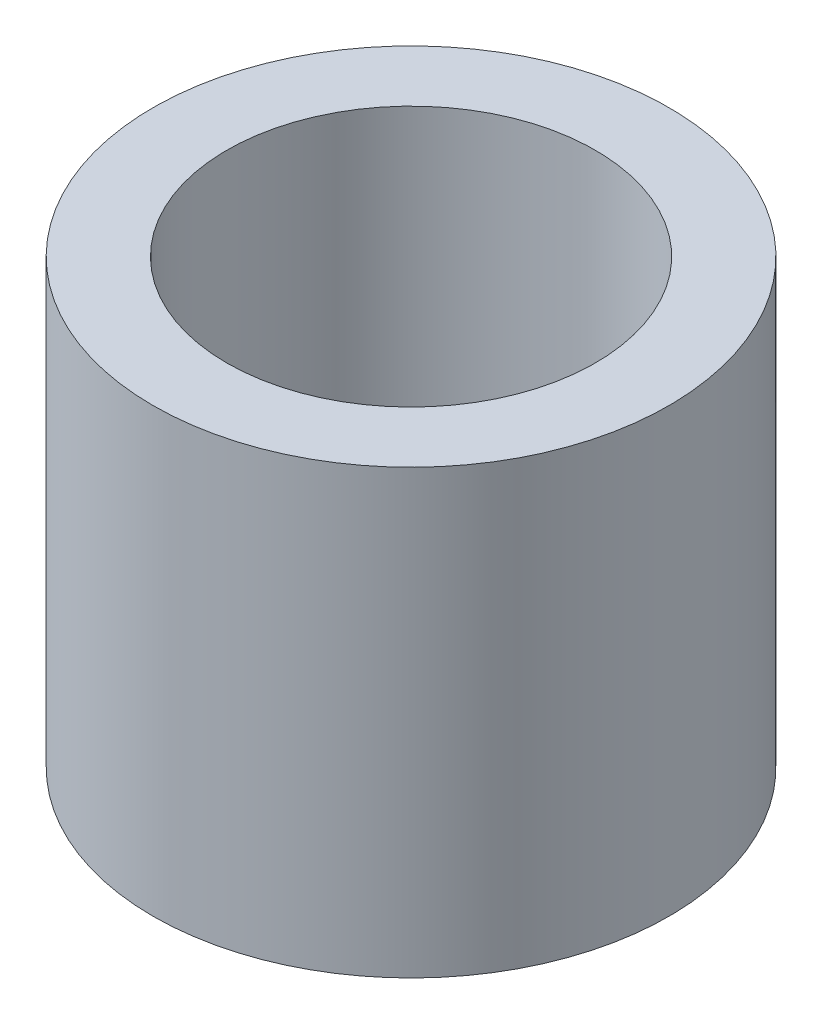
from build123d import *

# Parameters (mm, degrees)
ESQUISSE1_R      = 3.5
ESQUISSE1_R_2    = 2.5
EXTRUSION1_DEPTH = 6


with BuildPart() as part:
    # Esquisse1 → Extrusion1 (new body)
    with BuildSketch(Plane(origin=(0, 0, 0), x_dir=(1, 0, 0), z_dir=(0, 1, 0))):
        with Locations(Location((0, 0, 0), (0, 0, 270))):
            Circle(ESQUISSE1_R)
        with Locations(Location((0, 0, 0), (0, 0, 270))):
            Circle(ESQUISSE1_R_2, mode=Mode.SUBTRACT)
    extrude(amount=EXTRUSION1_DEPTH)


solid = part.part
